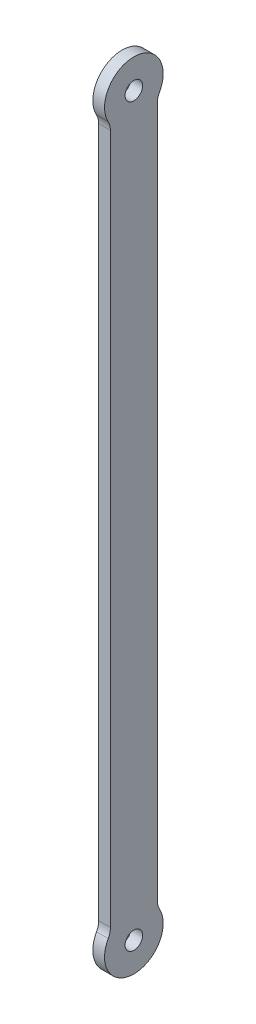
from build123d import *

# Parameters (mm, degrees)
SKETCH1_R           = 1.5
BOSS_EXTRUDE1_DEPTH = 2
BOSS_EXTRUDE2_START = -2
SKETCH2_R           = 5
SKETCH2_R_2         = 1.5
BOSS_EXTRUDE2_DEPTH = 2
FILLET1_R           = 3


with BuildPart() as part:
    # Sketch1 → Boss-Extrude1 (new body)
    with BuildSketch(Plane(origin=(0, 0, 0), x_dir=(0, 0, -1), z_dir=(1, 0, 0))):
        with BuildLine():
            Line((-4, 0), (-4, 125.52))
            ThreePointArc((-4, 125.52), (0, 129.52), (4, 125.52))
            Line((4, 125.52), (4, 0))
            ThreePointArc((4, 0), (0, -4), (-4, 0))
        make_face()
        with Locations((0, 125.52)):
            Circle(SKETCH1_R, mode=Mode.SUBTRACT)
        Circle(SKETCH1_R, mode=Mode.SUBTRACT)
    extrude(amount=BOSS_EXTRUDE1_DEPTH)

    # Sketch2 → Boss-Extrude2 (add)
    # profile 1 of 2: a face of its own
    with BuildSketch(Plane(origin=(2, 0, 0), x_dir=(0, 0, -1), z_dir=(1, 0, 0)).offset(BOSS_EXTRUDE2_START)):
        with Locations((0, 125.52)):
            Circle(SKETCH2_R)
        with Locations((0, 125.52)):
            Circle(SKETCH2_R_2, mode=Mode.SUBTRACT)
    # profile 2 of 2: a face of its own
    with BuildSketch(Plane(origin=(2, 0, 0), x_dir=(0, 0, -1), z_dir=(1, 0, 0)).offset(BOSS_EXTRUDE2_START)):
        Circle(SKETCH2_R)
        Circle(SKETCH2_R_2, mode=Mode.SUBTRACT)
    extrude(amount=BOSS_EXTRUDE2_DEPTH)

    # Fillet1
    fillet1_edges = [part.edges().sort_by_distance(p)[0] for p in [
        (1, 122.52, 4),
        (1, 122.52, -4),
        (1, 3, 4),
        (1, 3, -4),
    ]]
    fillet(fillet1_edges, radius=FILLET1_R)


solid = part.part
